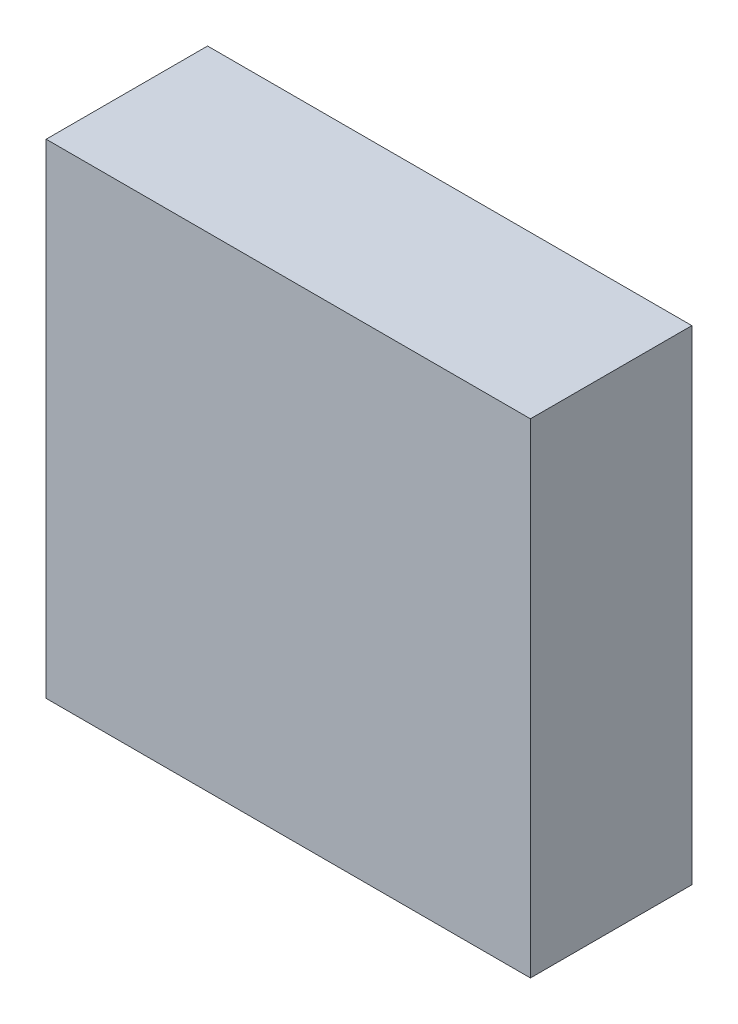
ISO-10303-21;
HEADER;
FILE_DESCRIPTION(('STEP AP214'),'2;1');
FILE_NAME('part.step','',(''),(''),'','','');
FILE_SCHEMA(('AUTOMOTIVE_DESIGN { 1 0 10303 214 1 1 1 1 }'));
ENDSEC;
DATA;
#1=APPLICATION_CONTEXT('core data for automotive mechanical design processes');
#2=APPLICATION_PROTOCOL_DEFINITION('international standard','automotive_design',2000,#1);
#3=PRODUCT_CONTEXT('',#1,'mechanical');
#4=PRODUCT('Part','Part','',(#3));
#5=PRODUCT_RELATED_PRODUCT_CATEGORY('part','',(#4));
#6=PRODUCT_DEFINITION_FORMATION('','',#4);
#7=PRODUCT_DEFINITION_CONTEXT('part definition',#1,'design');
#8=PRODUCT_DEFINITION('design','',#6,#7);
#9=PRODUCT_DEFINITION_SHAPE('','',#8);
#10=(LENGTH_UNIT() NAMED_UNIT(*) SI_UNIT(.MILLI.,.METRE.));
#11=(NAMED_UNIT(*) PLANE_ANGLE_UNIT() SI_UNIT($,.RADIAN.));
#12=(NAMED_UNIT(*) SI_UNIT($,.STERADIAN.) SOLID_ANGLE_UNIT());
#13=UNCERTAINTY_MEASURE_WITH_UNIT(LENGTH_MEASURE(1.E-05),#10,'distance_accuracy_value','');
#14=(GEOMETRIC_REPRESENTATION_CONTEXT(3) GLOBAL_UNCERTAINTY_ASSIGNED_CONTEXT((#13)) GLOBAL_UNIT_ASSIGNED_CONTEXT((#10,
#11,#12)) REPRESENTATION_CONTEXT('',''));
#15=CARTESIAN_POINT('',(0.,0.,0.));
#16=DIRECTION('',(0.,0.,1.));
#17=DIRECTION('',(1.,0.,0.));
#18=AXIS2_PLACEMENT_3D('',#15,#16,#17);
#19=CARTESIAN_POINT('',(-1.64699710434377,1.64872147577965,0.));
#20=DIRECTION('',(-8.74227765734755E-08,0.999999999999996,0.));
#21=DIRECTION('',(0.999999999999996,8.74227765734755E-08,0.));
#22=AXIS2_PLACEMENT_3D('',#19,#20,#21);
#23=PLANE('',#22);
#24=DIRECTION('',(0.,0.,1.));
#25=VECTOR('',#24,1.);
#26=CARTESIAN_POINT('',(-1.64699710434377,1.64872147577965,0.));
#27=LINE('',#26,#25);
#28=CARTESIAN_POINT('',(-1.64699710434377,1.64872147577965,0.));
#29=VERTEX_POINT('',#28);
#30=CARTESIAN_POINT('',(-1.64699710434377,1.64872147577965,1.10000034));
#31=VERTEX_POINT('',#30);
#32=EDGE_CURVE('E11',#29,#31,#27,.T.);
#33=ORIENTED_EDGE('',*,*,#32,.T.);
#34=DIRECTION('',(0.999999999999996,8.74227765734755E-08,0.));
#35=VECTOR('',#34,1.);
#36=CARTESIAN_POINT('',(-1.64699710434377,1.64872147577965,1.10000034));
#37=LINE('',#36,#35);
#38=CARTESIAN_POINT('',(1.65300137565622,1.64872176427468,1.10000034));
#39=VERTEX_POINT('',#38);
#40=EDGE_CURVE('E24',#31,#39,#37,.T.);
#41=ORIENTED_EDGE('',*,*,#40,.T.);
#42=DIRECTION('',(0.,0.,1.));
#43=VECTOR('',#42,1.);
#44=CARTESIAN_POINT('',(1.65300137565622,1.64872176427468,0.));
#45=LINE('',#44,#43);
#46=CARTESIAN_POINT('',(1.65300137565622,1.64872176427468,0.));
#47=VERTEX_POINT('',#46);
#48=EDGE_CURVE('E84',#47,#39,#45,.T.);
#49=ORIENTED_EDGE('',*,*,#48,.F.);
#50=DIRECTION('',(0.999999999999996,8.74227765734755E-08,0.));
#51=VECTOR('',#50,1.);
#52=CARTESIAN_POINT('',(-1.64699710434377,1.64872147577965,0.));
#53=LINE('',#52,#51);
#54=EDGE_CURVE('E82',#29,#47,#53,.T.);
#55=ORIENTED_EDGE('',*,*,#54,.F.);
#56=EDGE_LOOP('',(#33,#41,#49,#55));
#57=FACE_BOUND('',#56,.T.);
#58=ADVANCED_FACE('F17',(#57),#23,.T.);
#59=CARTESIAN_POINT('',(1.65300137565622,1.64872176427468,0.));
#60=DIRECTION('',(0.999999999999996,8.74227765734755E-08,0.));
#61=DIRECTION('',(8.74227765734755E-08,-0.999999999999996,0.));
#62=AXIS2_PLACEMENT_3D('',#59,#60,#61);
#63=PLANE('',#62);
#64=ORIENTED_EDGE('',*,*,#48,.T.);
#65=DIRECTION('',(8.74227765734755E-08,-0.999999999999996,0.));
#66=VECTOR('',#65,1.);
#67=CARTESIAN_POINT('',(1.65300137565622,1.64872176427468,1.10000034));
#68=LINE('',#67,#66);
#69=CARTESIAN_POINT('',(1.65300166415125,-1.6512767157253,1.10000034));
#70=VERTEX_POINT('',#69);
#71=EDGE_CURVE('E79',#39,#70,#68,.T.);
#72=ORIENTED_EDGE('',*,*,#71,.T.);
#73=DIRECTION('',(0.,0.,1.));
#74=VECTOR('',#73,1.);
#75=CARTESIAN_POINT('',(1.65300166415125,-1.6512767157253,0.));
#76=LINE('',#75,#74);
#77=CARTESIAN_POINT('',(1.65300166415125,-1.6512767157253,0.));
#78=VERTEX_POINT('',#77);
#79=EDGE_CURVE('E77',#78,#70,#76,.T.);
#80=ORIENTED_EDGE('',*,*,#79,.F.);
#81=DIRECTION('',(8.74227765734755E-08,-0.999999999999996,0.));
#82=VECTOR('',#81,1.);
#83=CARTESIAN_POINT('',(1.65300137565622,1.64872176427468,0.));
#84=LINE('',#83,#82);
#85=EDGE_CURVE('E68',#47,#78,#84,.T.);
#86=ORIENTED_EDGE('',*,*,#85,.F.);
#87=EDGE_LOOP('',(#64,#72,#80,#86));
#88=FACE_BOUND('',#87,.T.);
#89=ADVANCED_FACE('F90',(#88),#63,.T.);
#90=CARTESIAN_POINT('',(1.65300166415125,-1.6512767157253,0.));
#91=DIRECTION('',(8.74227765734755E-08,-0.999999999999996,0.));
#92=DIRECTION('',(-0.999999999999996,-8.74227765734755E-08,0.));
#93=AXIS2_PLACEMENT_3D('',#90,#91,#92);
#94=PLANE('',#93);
#95=ORIENTED_EDGE('',*,*,#79,.T.);
#96=DIRECTION('',(-0.999999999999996,-8.74227765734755E-08,0.));
#97=VECTOR('',#96,1.);
#98=CARTESIAN_POINT('',(1.65300166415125,-1.6512767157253,1.10000034));
#99=LINE('',#98,#97);
#100=CARTESIAN_POINT('',(-1.64699681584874,-1.65127700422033,1.10000034));
#101=VERTEX_POINT('',#100);
#102=EDGE_CURVE('E60',#70,#101,#99,.T.);
#103=ORIENTED_EDGE('',*,*,#102,.T.);
#104=DIRECTION('',(0.,0.,1.));
#105=VECTOR('',#104,1.);
#106=CARTESIAN_POINT('',(-1.64699681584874,-1.65127700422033,0.));
#107=LINE('',#106,#105);
#108=CARTESIAN_POINT('',(-1.64699681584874,-1.65127700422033,0.));
#109=VERTEX_POINT('',#108);
#110=EDGE_CURVE('E54',#109,#101,#107,.T.);
#111=ORIENTED_EDGE('',*,*,#110,.F.);
#112=DIRECTION('',(-0.999999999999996,-8.74227765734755E-08,0.));
#113=VECTOR('',#112,1.);
#114=CARTESIAN_POINT('',(1.65300166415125,-1.6512767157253,0.));
#115=LINE('',#114,#113);
#116=EDGE_CURVE('E58',#78,#109,#115,.T.);
#117=ORIENTED_EDGE('',*,*,#116,.F.);
#118=EDGE_LOOP('',(#95,#103,#111,#117));
#119=FACE_BOUND('',#118,.T.);
#120=ADVANCED_FACE('F57',(#119),#94,.T.);
#121=CARTESIAN_POINT('',(-1.64699681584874,-1.65127700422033,0.));
#122=DIRECTION('',(-0.999999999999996,-8.74227765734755E-08,0.));
#123=DIRECTION('',(-8.74227765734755E-08,0.999999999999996,0.));
#124=AXIS2_PLACEMENT_3D('',#121,#122,#123);
#125=PLANE('',#124);
#126=ORIENTED_EDGE('',*,*,#110,.T.);
#127=DIRECTION('',(-8.74227765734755E-08,0.999999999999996,0.));
#128=VECTOR('',#127,1.);
#129=CARTESIAN_POINT('',(-1.64699681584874,-1.65127700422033,1.10000034));
#130=LINE('',#129,#128);
#131=EDGE_CURVE('E69',#101,#31,#130,.T.);
#132=ORIENTED_EDGE('',*,*,#131,.T.);
#133=ORIENTED_EDGE('',*,*,#32,.F.);
#134=DIRECTION('',(-8.74227765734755E-08,0.999999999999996,0.));
#135=VECTOR('',#134,1.);
#136=CARTESIAN_POINT('',(-1.64699681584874,-1.65127700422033,0.));
#137=LINE('',#136,#135);
#138=EDGE_CURVE('E67',#109,#29,#137,.T.);
#139=ORIENTED_EDGE('',*,*,#138,.F.);
#140=EDGE_LOOP('',(#126,#132,#133,#139));
#141=FACE_BOUND('',#140,.T.);
#142=ADVANCED_FACE('F71',(#141),#125,.T.);
#143=CARTESIAN_POINT('',(-1.64699710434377,1.64872147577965,0.));
#144=DIRECTION('',(0.,0.,1.));
#145=DIRECTION('',(-0.999999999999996,-8.74227765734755E-08,0.));
#146=AXIS2_PLACEMENT_3D('',#143,#144,#145);
#147=PLANE('',#146);
#148=ORIENTED_EDGE('',*,*,#54,.T.);
#149=ORIENTED_EDGE('',*,*,#85,.T.);
#150=ORIENTED_EDGE('',*,*,#116,.T.);
#151=ORIENTED_EDGE('',*,*,#138,.T.);
#152=EDGE_LOOP('',(#148,#149,#150,#151));
#153=FACE_BOUND('',#152,.T.);
#154=ADVANCED_FACE('F66',(#153),#147,.F.);
#155=CARTESIAN_POINT('',(-1.64699710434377,1.64872147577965,1.10000034));
#156=DIRECTION('',(0.,0.,1.));
#157=DIRECTION('',(-0.999999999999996,-8.74227765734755E-08,0.));
#158=AXIS2_PLACEMENT_3D('',#155,#156,#157);
#159=PLANE('',#158);
#160=ORIENTED_EDGE('',*,*,#131,.F.);
#161=ORIENTED_EDGE('',*,*,#102,.F.);
#162=ORIENTED_EDGE('',*,*,#71,.F.);
#163=ORIENTED_EDGE('',*,*,#40,.F.);
#164=EDGE_LOOP('',(#160,#161,#162,#163));
#165=FACE_BOUND('',#164,.T.);
#166=ADVANCED_FACE('F91',(#165),#159,.T.);
#167=CLOSED_SHELL('',(#58,#89,#120,#142,#154,#166));
#168=MANIFOLD_SOLID_BREP('B1',#167);
#169=ADVANCED_BREP_SHAPE_REPRESENTATION('',(#18,#168),#14);
#170=SHAPE_DEFINITION_REPRESENTATION(#9,#169);
ENDSEC;
END-ISO-10303-21;
